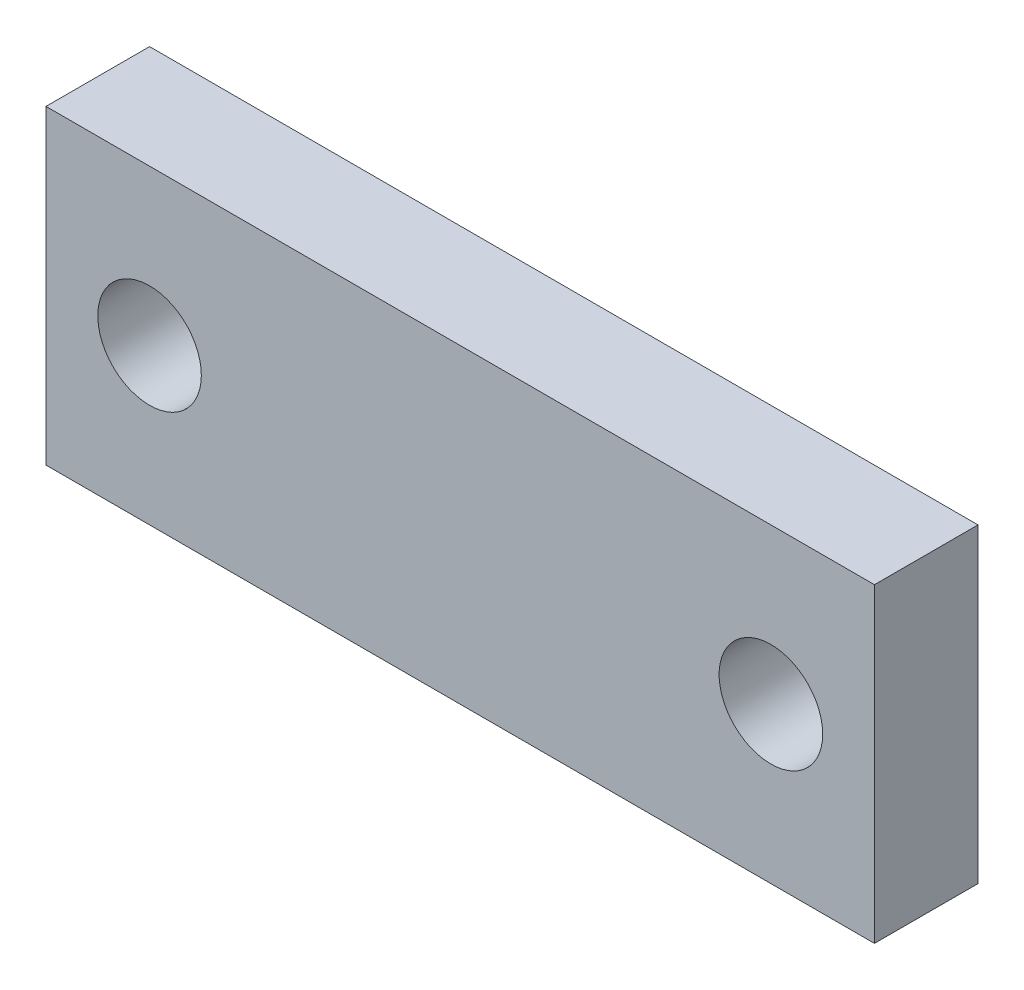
from build123d import *

# Parameters (mm, degrees)
SKIZZE1_W               = 80
SKIZZE1_H               = 30
SKIZZE1_R               = 5
LINEAR_AUSTRAGEN1_DEPTH = 10


with BuildPart() as part:
    # Skizze1 → Linear austragen1 (new body)
    with BuildSketch(Plane.XY):
        with Locations((-60, 15)):
            Rectangle(SKIZZE1_W, SKIZZE1_H)
        with Locations((-90, 15)):
            Circle(SKIZZE1_R, mode=Mode.SUBTRACT)
        with Locations((-30, 15)):
            Circle(SKIZZE1_R, mode=Mode.SUBTRACT)
    extrude(amount=LINEAR_AUSTRAGEN1_DEPTH)


solid = part.part
